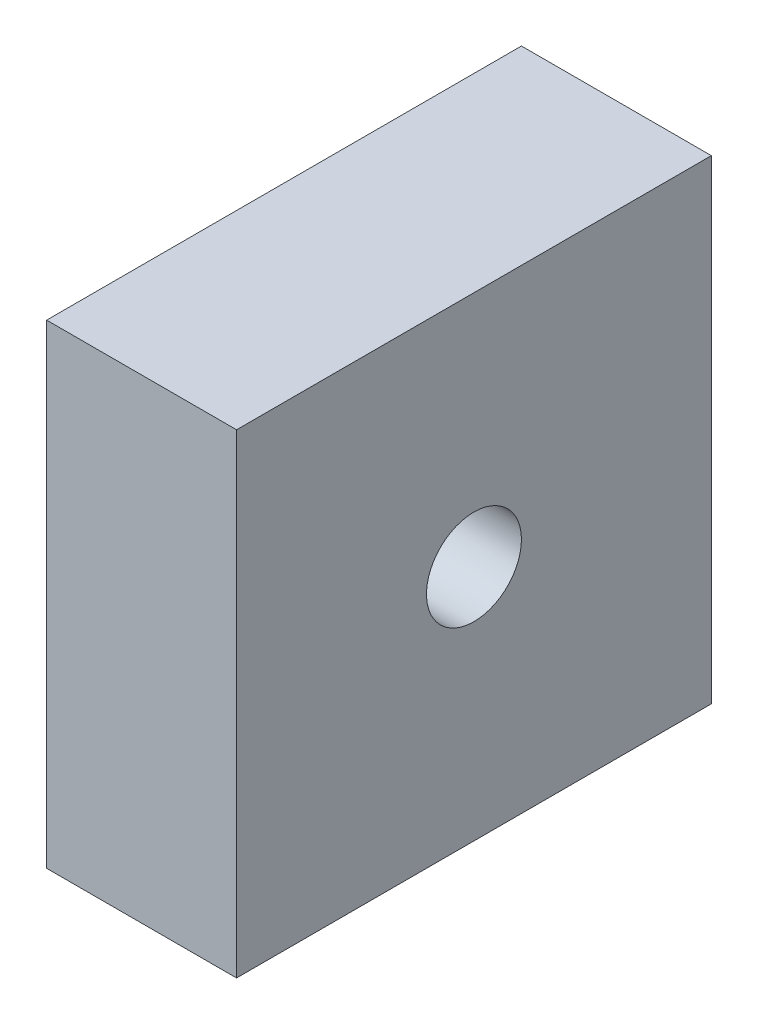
from build123d import *

# Parameters (mm, degrees)
SKETCH1_W           = 50
SKETCH1_H           = 50
SKETCH1_R           = 5
BOSS_EXTRUDE1_DEPTH = 20


with BuildPart() as part:
    # Sketch1 → Boss-Extrude1 (new body)
    with BuildSketch(Plane(origin=(0, 0, 0), x_dir=(0, 0, -1), z_dir=(1, 0, 0))):
        with Locations((25, 25)):
            Rectangle(SKETCH1_W, SKETCH1_H)
        with Locations((25, 25)):
            Circle(SKETCH1_R, mode=Mode.SUBTRACT)
    extrude(amount=BOSS_EXTRUDE1_DEPTH)


solid = part.part
